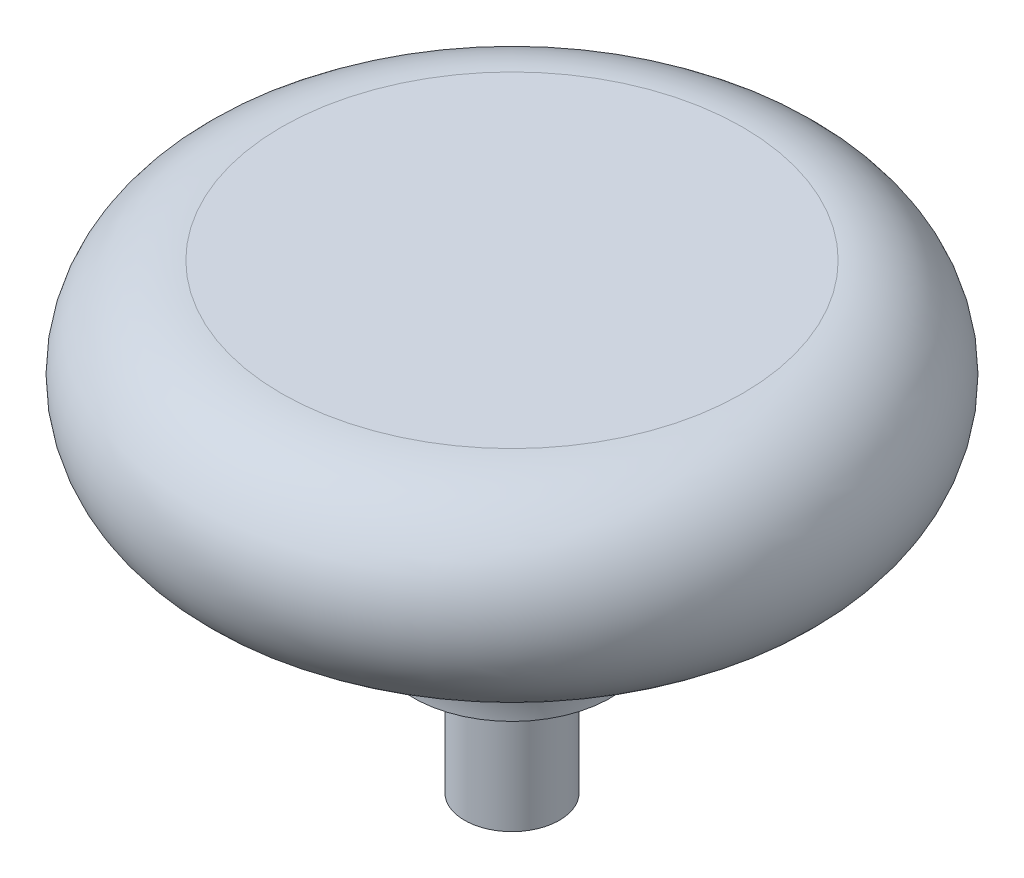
ISO-10303-21;
HEADER;
FILE_DESCRIPTION(('STEP AP214'),'2;1');
FILE_NAME('part.step','',(''),(''),'','','');
FILE_SCHEMA(('AUTOMOTIVE_DESIGN { 1 0 10303 214 1 1 1 1 }'));
ENDSEC;
DATA;
#1=APPLICATION_CONTEXT('core data for automotive mechanical design processes');
#2=APPLICATION_PROTOCOL_DEFINITION('international standard','automotive_design',2000,#1);
#3=PRODUCT_CONTEXT('',#1,'mechanical');
#4=PRODUCT('Part','Part','',(#3));
#5=PRODUCT_RELATED_PRODUCT_CATEGORY('part','',(#4));
#6=PRODUCT_DEFINITION_FORMATION('','',#4);
#7=PRODUCT_DEFINITION_CONTEXT('part definition',#1,'design');
#8=PRODUCT_DEFINITION('design','',#6,#7);
#9=PRODUCT_DEFINITION_SHAPE('','',#8);
#10=(LENGTH_UNIT() NAMED_UNIT(*) SI_UNIT(.MILLI.,.METRE.));
#11=(NAMED_UNIT(*) PLANE_ANGLE_UNIT() SI_UNIT($,.RADIAN.));
#12=(NAMED_UNIT(*) SI_UNIT($,.STERADIAN.) SOLID_ANGLE_UNIT());
#13=UNCERTAINTY_MEASURE_WITH_UNIT(LENGTH_MEASURE(1.E-05),#10,'distance_accuracy_value','');
#14=(GEOMETRIC_REPRESENTATION_CONTEXT(3) GLOBAL_UNCERTAINTY_ASSIGNED_CONTEXT((#13)) GLOBAL_UNIT_ASSIGNED_CONTEXT((#10,
#11,#12)) REPRESENTATION_CONTEXT('',''));
#15=CARTESIAN_POINT('',(0.,0.,0.));
#16=DIRECTION('',(0.,0.,1.));
#17=DIRECTION('',(1.,0.,0.));
#18=AXIS2_PLACEMENT_3D('',#15,#16,#17);
#19=CARTESIAN_POINT('',(2.286,0.,0.));
#20=DIRECTION('',(0.,1.,0.));
#21=DIRECTION('',(0.,0.,1.));
#22=AXIS2_PLACEMENT_3D('',#19,#20,#21);
#23=PLANE('',#22);
#24=CARTESIAN_POINT('',(0.,0.,0.));
#25=DIRECTION('',(0.,-1.,0.));
#26=DIRECTION('',(0.,0.,-1.));
#27=AXIS2_PLACEMENT_3D('',#24,#25,#26);
#28=CIRCLE('',#27,2.286);
#29=CARTESIAN_POINT('',(0.,0.,-2.286));
#30=VERTEX_POINT('',#29);
#31=EDGE_CURVE('E53',#30,#30,#28,.T.);
#32=ORIENTED_EDGE('',*,*,#31,.T.);
#33=EDGE_LOOP('',(#32));
#34=FACE_BOUND('',#33,.T.);
#35=ADVANCED_FACE('F34',(#34),#23,.F.);
#36=CARTESIAN_POINT('',(0.,22.225,0.));
#37=DIRECTION('',(0.,-1.,0.));
#38=DIRECTION('',(0.,0.,-1.));
#39=AXIS2_PLACEMENT_3D('',#36,#37,#38);
#40=PLANE('',#39);
#41=CARTESIAN_POINT('',(0.,22.225,0.));
#42=DIRECTION('',(0.,-1.,0.));
#43=DIRECTION('',(0.,0.,-1.));
#44=AXIS2_PLACEMENT_3D('',#41,#42,#43);
#45=CIRCLE('',#44,11.1125);
#46=CARTESIAN_POINT('',(0.,22.225,-11.1125));
#47=VERTEX_POINT('',#46);
#48=EDGE_CURVE('E10',#47,#47,#45,.T.);
#49=ORIENTED_EDGE('',*,*,#48,.F.);
#50=EDGE_LOOP('',(#49));
#51=FACE_BOUND('',#50,.T.);
#52=ADVANCED_FACE('F77',(#51),#40,.F.);
#53=CARTESIAN_POINT('',(0.,17.4625,0.));
#54=DIRECTION('',(0.,-1.,0.));
#55=DIRECTION('',(0.,0.,-1.));
#56=AXIS2_PLACEMENT_3D('',#53,#54,#55);
#57=TOROIDAL_SURFACE('',#56,11.1125,4.7625);
#58=CARTESIAN_POINT('',(0.,12.7,0.));
#59=DIRECTION('',(0.,-1.,0.));
#60=DIRECTION('',(0.,0.,-1.));
#61=AXIS2_PLACEMENT_3D('',#58,#59,#60);
#62=CIRCLE('',#61,11.1125);
#63=CARTESIAN_POINT('',(0.,12.7,-11.1125));
#64=VERTEX_POINT('',#63);
#65=EDGE_CURVE('E40',#64,#64,#62,.T.);
#66=ORIENTED_EDGE('',*,*,#65,.F.);
#67=EDGE_LOOP('',(#66));
#68=FACE_BOUND('',#67,.T.);
#69=ORIENTED_EDGE('',*,*,#48,.T.);
#70=EDGE_LOOP('',(#69));
#71=FACE_BOUND('',#70,.T.);
#72=ADVANCED_FACE('F72',(#68,#71),#57,.T.);
#73=CARTESIAN_POINT('',(0.,6.35,0.));
#74=DIRECTION('',(0.,-1.,0.));
#75=DIRECTION('',(0.,0.,-1.));
#76=AXIS2_PLACEMENT_3D('',#73,#74,#75);
#77=TOROIDAL_SURFACE('',#76,11.1125,6.35);
#78=CARTESIAN_POINT('',(0.,6.35,0.));
#79=DIRECTION('',(0.,-1.,0.));
#80=DIRECTION('',(0.,0.,-1.));
#81=AXIS2_PLACEMENT_3D('',#78,#79,#80);
#82=CIRCLE('',#81,4.7625);
#83=CARTESIAN_POINT('',(0.,6.35,-4.7625));
#84=VERTEX_POINT('',#83);
#85=EDGE_CURVE('E44',#84,#84,#82,.T.);
#86=ORIENTED_EDGE('',*,*,#85,.F.);
#87=EDGE_LOOP('',(#86));
#88=FACE_BOUND('',#87,.T.);
#89=ORIENTED_EDGE('',*,*,#65,.T.);
#90=EDGE_LOOP('',(#89));
#91=FACE_BOUND('',#90,.T.);
#92=ADVANCED_FACE('F67',(#88,#91),#77,.F.);
#93=CARTESIAN_POINT('',(4.7625,6.35,0.));
#94=DIRECTION('',(0.,1.,0.));
#95=DIRECTION('',(0.,0.,1.));
#96=AXIS2_PLACEMENT_3D('',#93,#94,#95);
#97=PLANE('',#96);
#98=CARTESIAN_POINT('',(0.,6.35,0.));
#99=DIRECTION('',(0.,-1.,0.));
#100=DIRECTION('',(0.,0.,-1.));
#101=AXIS2_PLACEMENT_3D('',#98,#99,#100);
#102=CIRCLE('',#101,2.286);
#103=CARTESIAN_POINT('',(0.,6.35,-2.286));
#104=VERTEX_POINT('',#103);
#105=EDGE_CURVE('E48',#104,#104,#102,.T.);
#106=ORIENTED_EDGE('',*,*,#105,.F.);
#107=EDGE_LOOP('',(#106));
#108=FACE_BOUND('',#107,.T.);
#109=ORIENTED_EDGE('',*,*,#85,.T.);
#110=EDGE_LOOP('',(#109));
#111=FACE_BOUND('',#110,.T.);
#112=ADVANCED_FACE('F61',(#108,#111),#97,.F.);
#113=CARTESIAN_POINT('',(0.,0.,0.));
#114=DIRECTION('',(0.,-1.,0.));
#115=DIRECTION('',(0.,0.,-1.));
#116=AXIS2_PLACEMENT_3D('',#113,#114,#115);
#117=CYLINDRICAL_SURFACE('',#116,2.286);
#118=ORIENTED_EDGE('',*,*,#31,.F.);
#119=EDGE_LOOP('',(#118));
#120=FACE_BOUND('',#119,.T.);
#121=ORIENTED_EDGE('',*,*,#105,.T.);
#122=EDGE_LOOP('',(#121));
#123=FACE_BOUND('',#122,.T.);
#124=ADVANCED_FACE('F58',(#120,#123),#117,.T.);
#125=CLOSED_SHELL('',(#35,#52,#72,#92,#112,#124));
#126=MANIFOLD_SOLID_BREP('B2',#125);
#127=ADVANCED_BREP_SHAPE_REPRESENTATION('',(#18,#126),#14);
#128=SHAPE_DEFINITION_REPRESENTATION(#9,#127);
ENDSEC;
END-ISO-10303-21;
